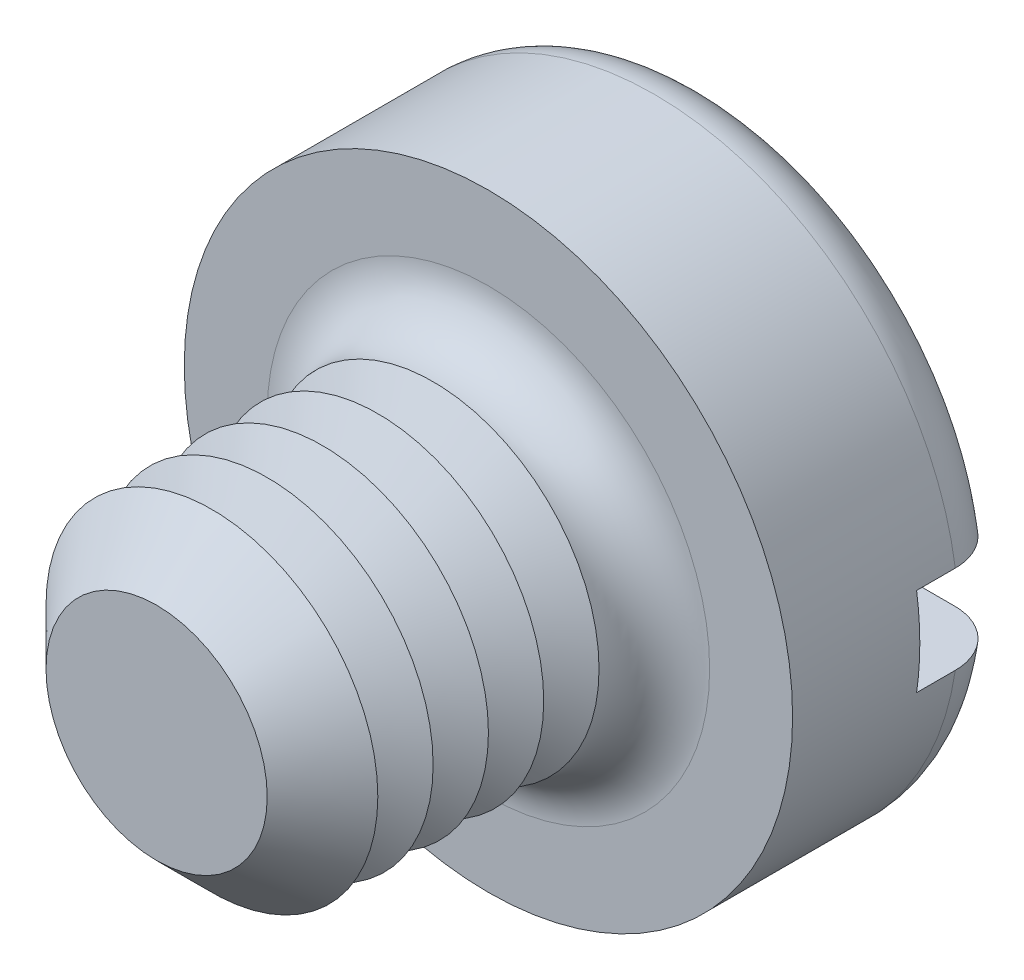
from build123d import *

# Parameters (mm, degrees)
SKETCH3_R           = 2.75
BOSS_EXTRUDE2_DEPTH = 2
SKETCH4_R           = 1.5
BOSS_EXTRUDE3_DEPTH = 3
FILLET1_R           = 0.5
CHAMFER1_SIZE       = 0.5
LPATTERN1_COUNT     = 4
LPATTERN1_PITCH     = 0.5
SKETCH8_W           = 5.5
SKETCH8_H           = 0.8
CUT_EXTRUDE1_DEPTH  = 0.85


with BuildPart() as part:
    # Sketch3 → Boss-Extrude2 (new body)
    with BuildSketch(Plane.XY):
        Circle(SKETCH3_R)
    extrude(amount=-BOSS_EXTRUDE2_DEPTH)

    # Sketch4 → Boss-Extrude3 (add)
    with BuildSketch(Plane.XY):
        Circle(SKETCH4_R)
    extrude(amount=BOSS_EXTRUDE3_DEPTH)

    # Fillet1
    fillet1_edges = [part.edges().sort_by_distance(p)[0] for p in [
        (-2.75, 0, -2),
        (-1.5, 0, 0),
    ]]
    fillet(fillet1_edges, radius=FILLET1_R)

    # Chamfer1
    chamfer1_edges = [part.edges().sort_by_distance(p)[0] for p in [
        (-1.5, 0, 3),
    ]]
    chamfer(chamfer1_edges, length=CHAMFER1_SIZE)

    # Sketch6 → Cut-Revolve1 (revolve, cut)
    with BuildSketch(Plane(origin=(0, 0, 0), x_dir=(0, 0, -1), z_dir=(1, 0, 0)), mode=Mode.PRIVATE) as cut_revolve1_sk:
        Polygon((-0.5, 1.5), (-0.75, 1.066987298), (-1, 1.5), align=None)
    cut_revolve1 = revolve(cut_revolve1_sk.sketch.rotate(Axis((0, 0, -1.694361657), (0, 0, 1)), 90), axis=Axis((0, 0, -1.694361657), (0, 0, 1)), mode=Mode.SUBTRACT)

    # LPattern1: Cut-Revolve1 ×4
    with Locations(*[(0, 0, i * LPATTERN1_PITCH) for i in range(1, LPATTERN1_COUNT)]):
        add(cut_revolve1, mode=Mode.SUBTRACT)

    # Sketch8 → Cut-Extrude1 (cut)
    with BuildSketch(Plane(origin=(0, 0, -2), x_dir=(-1, 0, 0), z_dir=(0, 0, -1))):
        Rectangle(SKETCH8_W, SKETCH8_H)
    extrude(amount=-CUT_EXTRUDE1_DEPTH, mode=Mode.SUBTRACT)


solid = part.part
